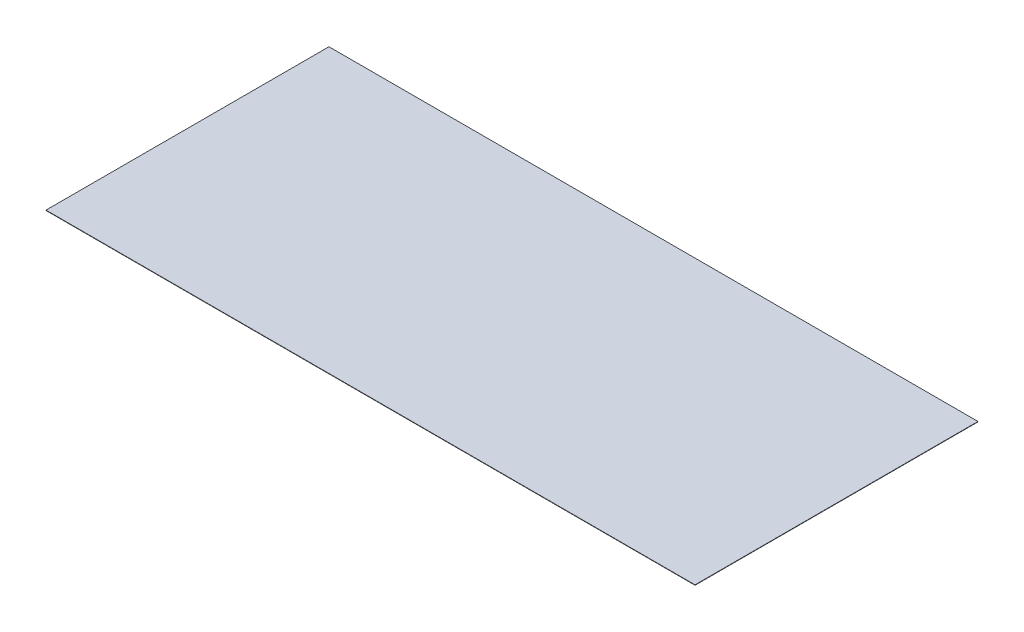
from build123d import *

# Parameters (mm, degrees)
SKETCH1_W           = 85.1
SKETCH1_H           = 37.1
BOSS_EXTRUDE1_DEPTH = 0.05


with BuildPart() as part:
    # Sketch1 → Boss-Extrude1 (new body)
    with BuildSketch(Plane(origin=(0, 0, 0), x_dir=(1, 0, 0), z_dir=(0, 1, 0))):
        with Locations((42.55, 18.55)):
            Rectangle(SKETCH1_W, SKETCH1_H)
    extrude(amount=BOSS_EXTRUDE1_DEPTH)


solid = part.part
